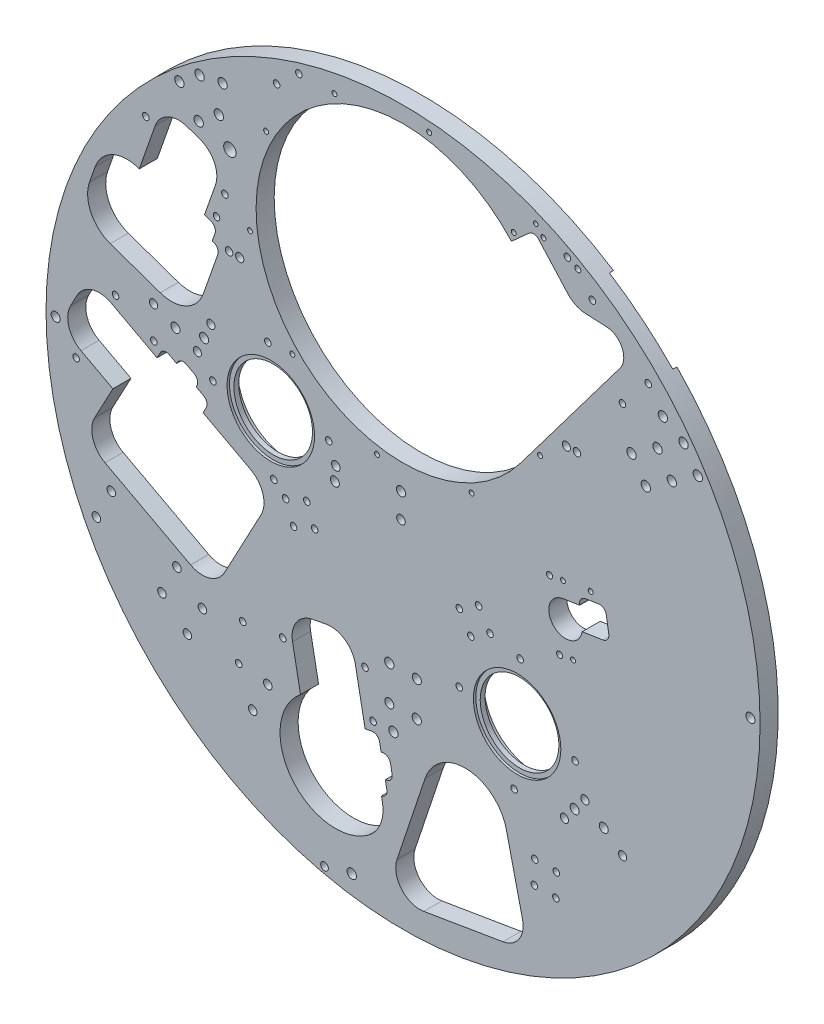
from build123d import *

# Parameters (mm, degrees)
SKETCH1_R                                      = 187.96
F_375_BASE_DEPTH                               = 9.525
CAROSEL_DEPTH                                  = 266.986181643
SKETCH5_R                                      = 20.701
HEATER_DEPTH                                   = 266.986181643
SKETCH8_R                                      = 27.0002
SKETCH8_R_2                                    = 27.00020001
HEATER_SEAL_DEPTH                              = 5.715
F_8_32_FOR_HEATERS_D                           = 3.4544
SKETCH9_R                                      = 23.0251
SAMPLE_HEATER_BORE_DEPTH                       = 1.27
F_3_16_FOR_CLAMPS_D                            = 4.7498
F_18_FOR_CLAMPS_D                              = 4.3053
SKETCH20_R                                     = 2.3749
LOCATING_PINS_FABRICATION_DEPTH                = 266.986181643
CAROUSEL_HALL_SENSOR_DEPTH                     = 266.986181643
FILLET3_R                                      = 3.556
F_5_40_TAPPED_HOLE1_D                          = 2.5781
F_3_32_0_093750_DIAMETER_HOLE1_D               = 2.38252
F_5_40_TAPPED_HOLE2_D                          = 2.5781
FILLET6_R                                      = 13.208
SKETCH41_R                                     = 27.978099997
CAROUSEL_DRIVE_DEPTH                           = 2.159
F_8_32_TAPPED_HOLE2_D                          = 3.4544
F_1_8_0_125000_DIAMETER_HOLE1_D                = 3.16738
F_8_32_TAPPED_HOLE3_D                          = 3.4544
COLLECTION_ROTARY_VALVE_TOP_D                  = 3.4544
INTERNAL_SAMPLER_DEPTH                         = 266.986181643
F_8_32_TAPPED_HOLE_SYRINGES_D                  = 3.4544
F_5_C_BORE_VALVE_MOUNTING_D                    = 3.4544
F_5_C_BORE_VALVE_MOUNTING_CBORE_D              = 6.35
F_5_C_BORE_VALVE_MOUNTING_CBORE_DEPTH          = 5.08
F_3_16_0_187500_DIAMETER_HOLE2_D               = 4.7498
F_10_0_193500_DIAMETER_HOLE2_D                 = 4.9149
CBORE_FOR_8_SOCKET_HEAD_CAP_SCREW1_D           = 4.5212
CBORE_FOR_8_SOCKET_HEAD_CAP_SCREW1_CBORE_D     = 7.366
CBORE_FOR_8_SOCKET_HEAD_CAP_SCREW1_CBORE_DEPTH = 5.08
F_3_16_0_187500_DIAMETER_HOLE3_D               = 4.7498
F_8_32_TAPPED_HOLE5_D                          = 3.4544
F_18_0_169500_DIAMETER_HOLE4_D                 = 4.3053
F_5_32_0_156250_DIAMETER_HOLE1_D               = 3.9624
F_10_0_1935_DIAMETER_HOLE1_D                   = 4.9149
CBORE_FOR_8_SOCKET_HEAD_CAP_SCREW2_D           = 4.4958
CBORE_FOR_8_SOCKET_HEAD_CAP_SCREW2_CBORE_D     = 7.9375
CBORE_FOR_8_SOCKET_HEAD_CAP_SCREW2_CBORE_DEPTH = 5.842
F_10_0_1935_DIAMETER_HOLE2_D                   = 4.9149
FLUSH_PUCK_HOLDER_DEPTH                        = 266.986181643
F_5_40_TAPPED_HOLE3_D                          = 2.5781
F_1_8_0_125_DIAMETER_HOLE1_D                   = 3.16738
PROCESSING_SYRINGE_DEPTH                       = 266.986181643
PRECIOUS_REAGENT_VALVE_DEPTH                   = 266.986181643
COLLECTION_SYRINGE_DEPTH                       = 266.986181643
F_10_0_1935_DIAMETER_HOLE3_D                   = 4.9149
F_0_257_DIAMETER_HOLE2_D                       = 6.5278
CUT_EXTRUDE7_DEPTH                             = 0.127
SKETCH94_R                                     = 2.4638
CUT_EXTRUDE8_DEPTH                             = 266.986181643
F_10_32_TAPPED_HOLE1_D                         = 4.0386


with BuildPart() as part:
    # Sketch1 → 375 base (new body)
    with BuildSketch(Plane.XY):
        with Locations(Location((0, 0, 0), (0, 0, 180))):
            Circle(SKETCH1_R)
    extrude(amount=F_375_BASE_DEPTH)

    # Sketch2 → carosel (cut, through all)
    with BuildSketch(Plane(origin=(0, 0, 0), x_dir=(-1, 0, 0), z_dir=(0, 0, -1))):
        with BuildLine():
            Line((-114.284247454, 125.157718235), (-61.772918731, 55.524336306))
            ThreePointArc((-61.772918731, 55.524336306), (77.281516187, 98.433971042), (-57.075052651, 154.34179727))
            Line((-57.075052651, 154.34179727), (-68.265403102, 142.114276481))
            Line((-68.265403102, 142.114276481), (-107.107515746, 140.393971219))
            ThreePointArc((-107.107515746, 140.393971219), (-115.295256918, 134.942288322), (-114.284247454, 125.157718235))
        make_face()
    extrude(amount=-CAROSEL_DEPTH, mode=Mode.SUBTRACT)

    # Sketch5 → heater (cut, through all)
    with BuildSketch(Plane(origin=(0, 0, 0), x_dir=(-1, 0, 0), z_dir=(0, 0, -1))):
        with Locations((69.616804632, 13.723398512)):
            Circle(SKETCH5_R)
        with Locations((-60.046419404, -64.185404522)):
            Circle(SKETCH5_R)
    extrude(amount=-HEATER_DEPTH, mode=Mode.SUBTRACT)

    # Sketch8 → heater seal (cut)
    with BuildSketch(Plane(origin=(0, 0, 0), x_dir=(-1, 0, 0), z_dir=(0, 0, -1))):
        with Locations((69.616804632, 13.723398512)):
            Circle(SKETCH8_R)
        with Locations((-60.046419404, -64.185404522)):
            Circle(SKETCH8_R_2)
    extrude(amount=-HEATER_SEAL_DEPTH, mode=Mode.SUBTRACT)

    # 8-32 for heaters (through all)
    with Locations(Plane.XY.offset(9.525)):
        with Locations((-100.10783128, 12.125431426), (-68.0188378, -16.767628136), (-71.214771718, 44.214424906), (-39.125778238, 15.321365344), (29.555392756, -62.587437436), (58.448452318, -94.676430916), (90.537446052, -65.783371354), (61.644386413, -33.694377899)):
            Hole(F_8_32_FOR_HEATERS_D / 2)

    # Sketch9 → Sample heater bore (cut)
    with BuildSketch(Plane.XY.offset(9.525)):
        with Locations((-69.616804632, 13.723398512)):
            Circle(SKETCH9_R)
        with Locations((60.046419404, -64.185404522)):
            Circle(SKETCH9_R)
    extrude(amount=-SAMPLE_HEATER_BORE_DEPTH, mode=Mode.SUBTRACT)

    # 3_16 for clamps (through all)
    with Locations(Plane.XY.offset(9.525)):
        with Locations((-104.724539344, 29.354369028), (-119.810856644, 26.506736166), (90.333833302, -87.848525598), (105.660927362, -88.735190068)):
            Hole(F_3_16_FOR_CLAMPS_D / 2)

    # 18 for clamps (through all)
    with Locations(Plane.XY.offset(9.525)):
        with Locations((-101.17063713, 37.336563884), (-131.34327173, 31.64129816), (-108.278441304, 21.372174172), (84.954429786, -94.733848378), (95.713237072, -80.963202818), (115.608617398, -96.507177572)):
            Hole(F_18_FOR_CLAMPS_D / 2)

    # Sketch20 → locating pins - fabrication (cut, through all)
    with BuildSketch(Plane(origin=(0, 0, 0), x_dir=(-1, 0, 0), z_dir=(0, 0, -1))):
        with Locations((182.88, 0)):
            Circle(SKETCH20_R)
        with Locations((-182.88, 0)):
            Circle(SKETCH20_R)
    extrude(amount=-LOCATING_PINS_FABRICATION_DEPTH, mode=Mode.SUBTRACT)

    # Sketch29 → carousel hall sensor (cut, through all)
    with BuildSketch(Plane(origin=(0, 0, 0), x_dir=(-1, 0, 0), z_dir=(0, 0, -1))):
        Polygon((-75.650603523, 127.743626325), (-54.101819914, 151.675975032), (-68.967549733, 165.061138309), (-90.516333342, 141.128789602), align=None)
    extrude(amount=-CAROUSEL_HALL_SENSOR_DEPTH, mode=Mode.SUBTRACT)

    # Fillet3
    fillet3_edges = [part.edges().sort_by_distance(p)[0] for p in [
        (68.967549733, 165.061138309, 4.7625),
    ]]
    fillet(fillet3_edges, radius=FILLET3_R)

    # 5-40 Tapped Hole1 (through all)
    with Locations(Plane(origin=(0, 0, 0), x_dir=(-1, 0, 0), z_dir=(0, 0, -1))):
        with Locations((-73.876422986, 164.354246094)):
            Hole(F_5_40_TAPPED_HOLE1_D / 2)

    # 3_32 _0.093750_ Diameter Hole1 (through all)
    with Locations(Plane(origin=(0, 0, 0), x_dir=(-1, 0, 0), z_dir=(0, 0, -1))):
        with Locations((-69.88238246, 168.79007771)):
            Hole(F_3_32_0_093750_DIAMETER_HOLE1_D / 2)

    # 5-40 Tapped Hole2 (through all)
    with Locations(Plane.XY.offset(9.525)):
        with Locations((36.078844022, 29.108006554), (58.27814354, 158.979258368), (13.71992176, 182.372847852), (-36.078844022, 175.107993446), (-13.71992176, 21.843152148), (-72.09671763, 139.959623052), (-80.576095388, 90.353218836), (-58.27814354, 45.236741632), (72.09671763, 64.256376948)):
            Hole(F_5_40_TAPPED_HOLE2_D / 2)

    # Fillet6
    fillet6_edges = [part.edges().sort_by_distance(p)[0] for p in [
        (90.516333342, 141.128789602, 4.7625),
    ]]
    fillet(fillet6_edges, radius=FILLET6_R)

    # Sketch41 → carousel drive (cut)
    with BuildSketch(Plane(origin=(0, 0, 0), x_dir=(-1, 0, 0), z_dir=(0, 0, -1))):
        with Locations((-106.686467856, 130.887290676)):
            Circle(SKETCH41_R)
    extrude(amount=-CAROUSEL_DRIVE_DEPTH, mode=Mode.SUBTRACT)

    # 8-32 Tapped Hole2 (through all)
    with Locations(Plane(origin=(0, 0, 2.159), x_dir=(-1, 0, 0), z_dir=(0, 0, -1))):
        with Locations((-99.646062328, 148.760401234), (-129.085362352, 125.509791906), (-115.50171972, 109.605389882)):
            Hole(F_8_32_TAPPED_HOLE2_D / 2)

    # 1_8 _0.125000_ Diameter Hole1 (through all)
    with Locations(Plane(origin=(0, 0, 0), x_dir=(-1, 0, 0), z_dir=(0, 0, -1))):
        with Locations((-91.9923738, 159.1778503)):
            Hole(F_1_8_0_125000_DIAMETER_HOLE1_D / 2)

    # 8-32 Tapped Hole3 (through all)
    with Locations(Plane(origin=(0, 0, 0), x_dir=(-1, 0, 0), z_dir=(0, 0, -1))):
        with Locations((-86.4987221, 161.835227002)):
            Hole(F_8_32_TAPPED_HOLE3_D / 2)

    # collection rotary valve - TOP (through all)
    with Locations(Plane.XY.offset(9.525)):
        with Locations((-86.555853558, -109.942157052), (-84.4318352, -89.733472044)):
            Hole(COLLECTION_ROTARY_VALVE_TOP_D / 2)

    # Sketch50 → Internal Sampler (cut, through all)
    with BuildSketch(Plane(origin=(0, 0, 0), x_dir=(-1, 0, 0), z_dir=(0, 0, -1))):
        with BuildLine():
            Line((106.870826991, 118.851784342), (113.702461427, 121.245921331))
            ThreePointArc((113.702461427, 121.245921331), (123.795791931, 120.683903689), (130.535447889, 113.14943476))
            Line((130.535447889, 113.14943476), (138.871807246, 89.361756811))
            Line((138.871807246, 89.361756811), (139.471073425, 89.571768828))
            ThreePointArc((139.471073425, 89.571768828), (153.058249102, 88.815206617), (162.130862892, 78.67265229))
            Line((162.130862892, 78.67265229), (165.051147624, 70.339663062))
            ThreePointArc((165.051147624, 70.339663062), (164.294585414, 56.752487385), (154.152031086, 47.679873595))
            Line((154.152031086, 47.679873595), (127.784319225, 38.439344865))
            ThreePointArc((127.784319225, 38.439344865), (114.197143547, 39.195907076), (105.124529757, 49.338461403))
            Line((105.124529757, 49.338461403), (97.522094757, 71.031897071))
            ThreePointArc((97.522094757, 71.031897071), (97.673407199, 73.749332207), (99.701918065, 75.563854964))
            Line((99.701918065, 75.563854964), (100.421037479, 75.815869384))
            Line((100.421037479, 75.815869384), (98.992955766, 79.890879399))
            ThreePointArc((98.992955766, 79.890879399), (99.144268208, 82.608314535), (101.172779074, 84.422837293))
            Line((101.172779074, 84.422837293), (104.528669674, 85.598904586))
            Line((104.528669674, 85.598904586), (98.77434042, 102.018797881))
            ThreePointArc((98.77434042, 102.018797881), (99.336358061, 112.112128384), (106.870826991, 118.851784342))
        make_face()
    extrude(amount=-INTERNAL_SAMPLER_DEPTH, mode=Mode.SUBTRACT)

    # 8-32 Tapped Hole _Syringes (through all)
    with Locations(Plane(origin=(0, 0, 0), x_dir=(-1, 0, 0), z_dir=(0, 0, -1))):
        with Locations((151.354249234, 25.515977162), (131.188829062, 14.748645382), (63.320319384, -86.662269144), (93.818355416, 100.416552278), (135.407428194, 114.991386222), (15.746835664, -100.854520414), (20.032792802, -78.399895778), (172.111271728, -13.358471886), (98.186605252, 87.951815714)):
            Hole(F_8_32_TAPPED_HOLE_SYRINGES_D / 2)

    # 5 C_bore valve mounting (through all)
    with Locations(Plane(origin=(0, 0, 0), x_dir=(-1, 0, 0), z_dir=(0, 0, -1))):
        with Locations((61.794718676, -22.42056349), (50.687393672, -18.045271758), (57.635757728, -32.978700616), (46.528432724, -28.603408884), (-35.644602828, -36.398314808), (-29.631216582, -26.774884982), (-39.755214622, -20.448708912), (-45.768600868, -30.072138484), (-80.666712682, -121.416835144), (-69.320700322, -121.21878982), (-80.45836588, -133.353017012), (-69.11235352, -133.154971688)):
            CounterBoreHole(F_5_C_BORE_VALVE_MOUNTING_D / 2, F_5_C_BORE_VALVE_MOUNTING_CBORE_D / 2, F_5_C_BORE_VALVE_MOUNTING_CBORE_DEPTH)

    # 3_16 _0.187500_ Diameter Hole2 (through all)
    with Locations(Plane.XY.offset(9.525)):
        with Locations((-7.239, -88.392), (7.239, -70.104)):
            Hole(F_3_16_0_187500_DIAMETER_HOLE2_D / 2)

    # 10 _0.193500_ Diameter Hole2 (through all)
    with Locations(Plane.XY.offset(9.525)):
        with Locations((7.239, -88.392), (-7.239, -70.104)):
            Hole(F_10_0_193500_DIAMETER_HOLE2_D / 2)

    # CBORE for _8 Socket Head Cap Screw1 (through all)
    with Locations(Plane(origin=(0, 0, 0), x_dir=(-1, 0, 0), z_dir=(0, 0, -1))):
        with Locations((35.37331, 5.757399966), (1.08331, -1.634000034)):
            CounterBoreHole(CBORE_FOR_8_SOCKET_HEAD_CAP_SCREW1_D / 2, CBORE_FOR_8_SOCKET_HEAD_CAP_SCREW1_CBORE_D / 2, CBORE_FOR_8_SOCKET_HEAD_CAP_SCREW1_CBORE_DEPTH)

    # 3_16 _0.187500_ Diameter Hole3 (through all)
    with Locations(Plane(origin=(0, 0, 0), x_dir=(-1, 0, 0), z_dir=(0, 0, -1))):
        with Locations((1.08331, 11.319999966), (35.89401, -1.634000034)):
            Hole(F_3_16_0_187500_DIAMETER_HOLE3_D / 2)

    # 8-32 Tapped Hole5 (through all)
    with Locations(Plane(origin=(0, 0, 0), x_dir=(-1, 0, 0), z_dir=(0, 0, -1))):
        with Locations((66.569437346, 164.27334176), (54.86639268, 174.810810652)):
            Hole(F_8_32_TAPPED_HOLE5_D / 2)

    # 18 _0.169500_ Diameter Hole4 (through all)
    with Locations(Plane(origin=(0, 0, 0), x_dir=(-1, 0, 0), z_dir=(0, 0, -1))):
        with Locations((85.979, 75.438), (-85.979, 75.438)):
            Hole(F_18_0_169500_DIAMETER_HOLE4_D / 2)

    # 5_32 _0.156250_ Diameter Hole1 (through all)
    with Locations(Plane(origin=(0, 0, 0), x_dir=(-1, 0, 0), z_dir=(0, 0, -1))):
        with Locations((-91.567, 75.438), (91.567, 75.438)):
            Hole(F_5_32_0_156250_DIAMETER_HOLE1_D / 2)

    # 10 _0.1935_ Diameter Hole1 (through all)
    with Locations(Plane(origin=(0, 0, 0), x_dir=(-1, 0, 0), z_dir=(0, 0, -1))):
        with Locations((-136.771817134, 114.370833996), (94.994039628, 150.364317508)):
            Hole(F_10_0_1935_DIAMETER_HOLE1_D / 2)

    # CBORE for _8 Socket Head Cap Screw2 (through all)
    with Locations(Plane(origin=(0, 0, 0), x_dir=(-1, 0, 0), z_dir=(0, 0, -1))):
        with Locations((79.124739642, -127.488478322), (71.20515858, -111.85387205), (105.646610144, -94.407838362), (113.566191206, -110.042444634), (119.07189292, -82.2124848), (126.91980458, -97.883188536), (161.440775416, -80.595035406), (153.592863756, -64.924331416)):
            CounterBoreHole(CBORE_FOR_8_SOCKET_HEAD_CAP_SCREW2_D / 2, CBORE_FOR_8_SOCKET_HEAD_CAP_SCREW2_CBORE_D / 2, CBORE_FOR_8_SOCKET_HEAD_CAP_SCREW2_CBORE_DEPTH)

    # 10 _0.1935_ Diameter Hole2 (through all)
    with Locations(Plane(origin=(0, 0, 0), x_dir=(-1, 0, 0), z_dir=(0, 0, -1))):
        with Locations((5.06776101, -100.338926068)):
            Hole(F_10_0_1935_DIAMETER_HOLE2_D / 2)

    # Sketch77 → flush puck holder (cut, through all)
    with BuildSketch(Plane(origin=(0, 0, 0), x_dir=(-1, 0, 0), z_dir=(0, 0, -1))):
        with BuildLine():
            Line((-93.008655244, 6.395647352), (-92.949053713, 6.771956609))
            ThreePointArc((-92.949053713, 6.771956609), (-93.58440902, 9.418401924), (-95.904992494, 10.840457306))
            Line((-95.904992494, 10.840457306), (-102.929431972, 11.953019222))
            ThreePointArc((-102.929431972, 11.953019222), (-105.575877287, 11.317663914), (-106.997932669, 8.99708044))
            Line((-106.997932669, 8.99708044), (-108.299889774, 0.776846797))
            ThreePointArc((-108.299889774, 0.776846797), (-107.664534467, -1.869598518), (-105.343950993, -3.2916539))
            Line((-105.343950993, -3.2916539), (-94.274529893, -5.044877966))
            ThreePointArc((-94.274529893, -5.044877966), (-79.327316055, -9.984749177), (-84.16686909, 4.995246))
            Line((-84.16686909, 4.995246), (-93.008655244, 6.395647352))
        make_face()
    extrude(amount=-FLUSH_PUCK_HOLDER_DEPTH, mode=Mode.SUBTRACT)

    # 5-40 Tapped Hole3 (through all)
    with Locations(Plane(origin=(0, 0, 0), x_dir=(-1, 0, 0), z_dir=(0, 0, -1))):
        with Locations((-89.46420385, -20.332393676), (-84.139800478, 13.284566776), (-98.75166178, 15.598858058)):
            Hole(F_5_40_TAPPED_HOLE3_D / 2)

    # 1_8 _0.125_ Diameter Hole1 (through all)
    with Locations(Plane(origin=(0, 0, 0), x_dir=(-1, 0, 0), z_dir=(0, 0, -1))):
        with Locations((-82.439764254, -21.444955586), (-77.115360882, 12.172004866)):
            Hole(F_1_8_0_125_DIAMETER_HOLE1_D / 2)

    # Sketch87 → processing syringe (cut, through all)
    with BuildSketch(Plane(origin=(0, 0, 0), x_dir=(-1, 0, 0), z_dir=(0, 0, -1))):
        with BuildLine():
            Line((19.980497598, -106.446439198), (25.123646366, -79.50088957))
            ThreePointArc((25.123646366, -79.50088957), (30.674609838, -71.052340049), (40.573760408, -69.003437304))
            Line((40.573760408, -69.003437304), (47.68439156, -70.360657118))
            ThreePointArc((47.68439156, -70.360657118), (56.132941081, -75.911620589), (58.181843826, -85.81077116))
            Line((58.181843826, -85.81077116), (53.979974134, -107.82485114))
            ThreePointArc((53.979974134, -107.82485114), (58.661056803, -148.371234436), (18.23728063, -154.013933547))
            ThreePointArc((18.23728063, -154.013933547), (11.839005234, -145.681153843), (10.868189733, -135.220242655))
            Line((10.868189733, -135.220242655), (11.344407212, -132.725284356))
            ThreePointArc((11.344407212, -132.725284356), (9.069797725, -131.23079419), (8.518170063, -128.565638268))
            Line((8.518170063, -128.565638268), (9.327739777, -124.32420916))
            Line((9.327739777, -124.32420916), (8.579252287, -124.181343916))
            ThreePointArc((8.579252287, -124.181343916), (6.3046428, -122.68685375), (5.753015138, -120.021697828))
            Line((5.753015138, -120.021697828), (6.6102066, -115.53077289))
            ThreePointArc((6.6102066, -115.53077289), (8.104696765, -113.256163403), (10.769852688, -112.704535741))
            Line((10.769852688, -112.704535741), (11.518340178, -112.847400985))
            Line((11.518340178, -112.847400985), (12.327909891, -108.605971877))
            ThreePointArc((12.327909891, -108.605971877), (13.822400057, -106.33136239), (16.48755598, -105.779734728))
            Line((16.48755598, -105.779734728), (19.980497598, -106.446439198))
        make_face()
    extrude(amount=-PROCESSING_SYRINGE_DEPTH, mode=Mode.SUBTRACT)

    # Sketch88 → precious reagent valve (cut, through all)
    with BuildSketch(Plane(origin=(0, 0, 0), x_dir=(-1, 0, 0), z_dir=(0, 0, -1))):
        with BuildLine():
            Line((-11.644016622, -113.165187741), (3.204004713, -157.662869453))
            ThreePointArc((3.204004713, -157.662869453), (0.81123781, -169.93411481), (-10.937626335, -174.208806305))
            Line((-10.937626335, -174.208806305), (-52.614983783, -167.239522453))
            ThreePointArc((-52.614983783, -167.239522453), (-61.084223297, -161.762919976), (-62.891132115, -151.840406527))
            Line((-62.891132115, -151.840406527), (-54.375130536, -115.172124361))
            ThreePointArc((-54.375130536, -115.172124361), (-33.768988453, -97.999414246), (-11.644016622, -113.165187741))
        make_face()
    extrude(amount=-PRECIOUS_REAGENT_VALVE_DEPTH, mode=Mode.SUBTRACT)

    # Sketch40 → Collection syringe (cut, through all)
    with BuildSketch(Plane(origin=(0, 0, 0), x_dir=(-1, 0, 0), z_dir=(0, 0, -1))):
        with BuildLine():
            Line((153.6947777, 20.86292408), (129.496273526, 7.942126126))
            Line((129.496273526, 7.942126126), (127.821355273, 11.07896926))
            ThreePointArc((127.821355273, 11.07896926), (125.718249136, 12.806480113), (123.009593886, 12.54089414))
            Line((123.009593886, 12.54089414), (119.200570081, 10.507064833))
            Line((119.200570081, 10.507064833), (118.841659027, 11.179245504))
            ThreePointArc((118.841659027, 11.179245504), (116.73855289, 12.906756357), (114.02989764, 12.641170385))
            Line((114.02989764, 12.641170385), (109.996813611, 10.487704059))
            ThreePointArc((109.996813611, 10.487704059), (108.269302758, 8.384597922), (108.534888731, 5.675942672))
            Line((108.534888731, 5.675942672), (108.893799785, 5.003762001))
            Line((108.893799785, 5.003762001), (105.08477598, 2.969932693))
            ThreePointArc((105.08477598, 2.969932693), (103.357265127, 0.866826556), (103.622851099, -1.841828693))
            Line((103.622851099, -1.841828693), (105.297769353, -4.978671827))
            Line((105.297769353, -4.978671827), (80.203024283, -18.378017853))
            ThreePointArc((80.203024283, -18.378017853), (73.786555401, -26.189554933), (74.773017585, -36.250274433))
            Line((74.773017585, -36.250274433), (93.974758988, -72.211940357))
            ThreePointArc((93.974758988, -72.211940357), (101.786296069, -78.62840924), (111.847015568, -77.641947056))
            Line((111.847015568, -77.641947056), (156.883120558, -53.594906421))
            ThreePointArc((156.883120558, -53.594906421), (163.29958944, -45.78336934), (162.313127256, -35.722649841))
            Line((162.313127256, -35.722649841), (152.742165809, -17.797831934))
            Line((152.742165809, -17.797831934), (169.546682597, -8.825055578))
            ThreePointArc((169.546682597, -8.825055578), (175.963151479, -1.013518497), (174.976689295, 9.047201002))
            Line((174.976689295, 9.047201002), (171.56703428, 15.432917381))
            ThreePointArc((171.56703428, 15.432917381), (163.755497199, 21.849386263), (153.6947777, 20.86292408))
        make_face()
    extrude(amount=-COLLECTION_SYRINGE_DEPTH, mode=Mode.SUBTRACT)

    # 10 _0.1935_ Diameter Hole3 (through all)
    with Locations(Plane.XY.offset(9.525)):
        with Locations((155.167743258, 96.542911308), (147.639888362, 107.703415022), (141.480332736, 87.310636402), (133.952478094, 98.47114037), (127.792922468, 78.078361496), (120.265067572, 89.238865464), (-117.739893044, 139.767234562), (-107.57532206, 126.757177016), (-107.131692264, 148.055269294), (-96.96712128, 135.045211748)):
            Hole(F_10_0_1935_DIAMETER_HOLE3_D / 2)

    # F _0.257_ Diameter Hole2 (through all)
    with Locations(Plane.XY.offset(9.525)):
        with Locations((-91.168731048, 122.011590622)):
            Hole(F_0_257_DIAMETER_HOLE2_D / 2)

    # Sketch93 → Cut-Extrude7 (cut)
    with BuildSketch(Plane.XY):
        with BuildLine():
            Line((-0.0254, 187.744098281), (0, 187.744098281))
            Line((0, 187.744098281), (0, 187.667898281))
            Line((0, 187.667898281), (-0.0254, 187.667898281))
            ThreePointArc((-0.0254, 187.667898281), (-0.0635, 187.705998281), (-0.0254, 187.744098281))
        make_face()
        with BuildLine():
            Line((187.6679, 0.0254), (187.6679, 0))
            Line((187.6679, 0), (187.7441, 0))
            Line((187.7441, 0), (187.7441, 0.0254))
            ThreePointArc((187.7441, 0.0254), (187.706, 0.0635), (187.6679, 0.0254))
        make_face()
    extrude(amount=CUT_EXTRUDE7_DEPTH, mode=Mode.SUBTRACT)

    # Sketch94 → Cut-Extrude8 (cut, through all)
    with BuildSketch(Plane.XY.offset(9.525)):
        with Locations((-27.000137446, -175.994941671)):
            Circle(SKETCH94_R)
    extrude(amount=-CUT_EXTRUDE8_DEPTH, mode=Mode.SUBTRACT)

    # 10-32 Tapped Hole1 (through all)
    with Locations(Plane(origin=(-41.3512, -179.832, 9.525), x_dir=(1, 0, 0), z_dir=(0, 0, 1))):
        with Locations((0, 0)):
            Hole(F_10_32_TAPPED_HOLE1_D / 2)


solid = part.part
